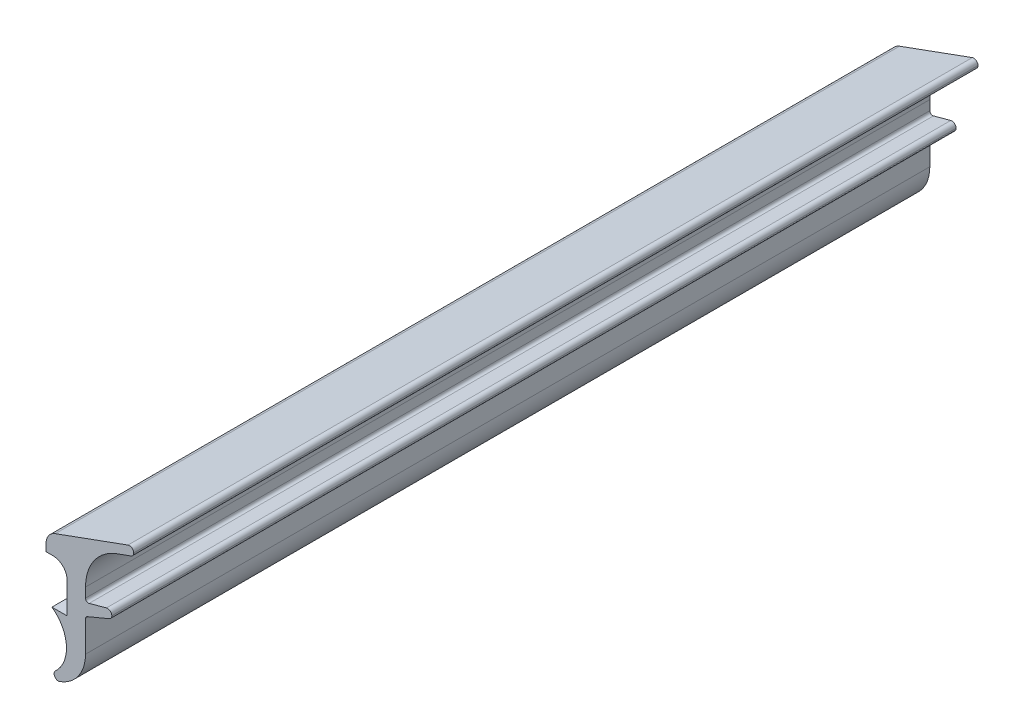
ISO-10303-21;
HEADER;
FILE_DESCRIPTION(('STEP AP214'),'2;1');
FILE_NAME('part.step','',(''),(''),'','','');
FILE_SCHEMA(('AUTOMOTIVE_DESIGN { 1 0 10303 214 1 1 1 1 }'));
ENDSEC;
DATA;
#1=APPLICATION_CONTEXT('core data for automotive mechanical design processes');
#2=APPLICATION_PROTOCOL_DEFINITION('international standard','automotive_design',2000,#1);
#3=PRODUCT_CONTEXT('',#1,'mechanical');
#4=PRODUCT('Part','Part','',(#3));
#5=PRODUCT_RELATED_PRODUCT_CATEGORY('part','',(#4));
#6=PRODUCT_DEFINITION_FORMATION('','',#4);
#7=PRODUCT_DEFINITION_CONTEXT('part definition',#1,'design');
#8=PRODUCT_DEFINITION('design','',#6,#7);
#9=PRODUCT_DEFINITION_SHAPE('','',#8);
#10=(LENGTH_UNIT() NAMED_UNIT(*) SI_UNIT(.MILLI.,.METRE.));
#11=(NAMED_UNIT(*) PLANE_ANGLE_UNIT() SI_UNIT($,.RADIAN.));
#12=(NAMED_UNIT(*) SI_UNIT($,.STERADIAN.) SOLID_ANGLE_UNIT());
#13=UNCERTAINTY_MEASURE_WITH_UNIT(LENGTH_MEASURE(1.E-05),#10,'distance_accuracy_value','');
#14=(GEOMETRIC_REPRESENTATION_CONTEXT(3) GLOBAL_UNCERTAINTY_ASSIGNED_CONTEXT((#13)) GLOBAL_UNIT_ASSIGNED_CONTEXT((#10,
#11,#12)) REPRESENTATION_CONTEXT('',''));
#15=CARTESIAN_POINT('',(0.,0.,0.));
#16=DIRECTION('',(0.,0.,1.));
#17=DIRECTION('',(1.,0.,0.));
#18=AXIS2_PLACEMENT_3D('',#15,#16,#17);
#19=CARTESIAN_POINT('',(1.26999999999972,0.635,0.));
#20=DIRECTION('',(0.,0.,1.));
#21=DIRECTION('',(1.,0.,0.));
#22=AXIS2_PLACEMENT_3D('',#19,#20,#21);
#23=PLANE('',#22);
#24=CARTESIAN_POINT('',(1.26999999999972,0.635,0.));
#25=DIRECTION('',(0.,0.,1.));
#26=DIRECTION('',(1.,0.,0.));
#27=AXIS2_PLACEMENT_3D('',#24,#25,#26);
#28=CIRCLE('',#27,1.26999999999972);
#29=CARTESIAN_POINT('',(0.835279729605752,1.82828047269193,0.));
#30=VERTEX_POINT('',#29);
#31=CARTESIAN_POINT('',(0.,0.635,0.));
#32=VERTEX_POINT('',#31);
#33=EDGE_CURVE('E417',#30,#32,#28,.T.);
#34=ORIENTED_EDGE('',*,*,#33,.T.);
#35=DIRECTION('',(0.,1.,0.));
#36=VECTOR('',#35,1.);
#37=CARTESIAN_POINT('',(0.,0.,0.));
#38=LINE('',#37,#36);
#39=CARTESIAN_POINT('',(0.,0.,0.));
#40=VERTEX_POINT('',#39);
#41=EDGE_CURVE('E18',#40,#32,#38,.T.);
#42=ORIENTED_EDGE('',*,*,#41,.F.);
#43=DIRECTION('',(-1.,0.,0.));
#44=VECTOR('',#43,1.);
#45=CARTESIAN_POINT('',(0.635,0.,0.));
#46=LINE('',#45,#44);
#47=CARTESIAN_POINT('',(0.635,0.,0.));
#48=VERTEX_POINT('',#47);
#49=EDGE_CURVE('E339',#48,#40,#46,.T.);
#50=ORIENTED_EDGE('',*,*,#49,.F.);
#51=CARTESIAN_POINT('',(0.635,-1.27,0.));
#52=DIRECTION('',(0.,0.,1.));
#53=DIRECTION('',(1.,0.,0.));
#54=AXIS2_PLACEMENT_3D('',#51,#52,#53);
#55=CIRCLE('',#54,1.27);
#56=CARTESIAN_POINT('',(1.905,-1.27,0.));
#57=VERTEX_POINT('',#56);
#58=EDGE_CURVE('E331',#57,#48,#55,.T.);
#59=ORIENTED_EDGE('',*,*,#58,.F.);
#60=DIRECTION('',(0.,1.,0.));
#61=VECTOR('',#60,1.);
#62=CARTESIAN_POINT('',(1.905,-4.064,0.));
#63=LINE('',#62,#61);
#64=CARTESIAN_POINT('',(1.905,-4.064,0.));
#65=VERTEX_POINT('',#64);
#66=EDGE_CURVE('E322',#65,#57,#63,.T.);
#67=ORIENTED_EDGE('',*,*,#66,.F.);
#68=DIRECTION('',(1.,0.,0.));
#69=VECTOR('',#68,1.);
#70=CARTESIAN_POINT('',(0.53339999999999,-4.064,0.));
#71=LINE('',#70,#69);
#72=CARTESIAN_POINT('',(0.533399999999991,-4.064,0.));
#73=VERTEX_POINT('',#72);
#74=EDGE_CURVE('E310',#73,#65,#71,.T.);
#75=ORIENTED_EDGE('',*,*,#74,.F.);
#76=CARTESIAN_POINT('',(-1.26875653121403,-6.60747603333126,0.));
#77=DIRECTION('',(0.,0.,1.));
#78=DIRECTION('',(1.,0.,0.));
#79=AXIS2_PLACEMENT_3D('',#76,#77,#78);
#80=CIRCLE('',#79,3.11721646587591);
#81=CARTESIAN_POINT('',(1.84845993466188,-6.60747603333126,0.));
#82=VERTEX_POINT('',#81);
#83=EDGE_CURVE('E366',#82,#73,#80,.T.);
#84=ORIENTED_EDGE('',*,*,#83,.F.);
#85=CARTESIAN_POINT('',(-1.26875653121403,-6.60747603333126,0.));
#86=DIRECTION('',(0.,0.,1.));
#87=DIRECTION('',(1.,0.,0.));
#88=AXIS2_PLACEMENT_3D('',#85,#86,#87);
#89=CIRCLE('',#88,3.11721646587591);
#90=CARTESIAN_POINT('',(0.85149478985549,-8.8925521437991,0.));
#91=VERTEX_POINT('',#90);
#92=EDGE_CURVE('E309',#91,#82,#89,.T.);
#93=ORIENTED_EDGE('',*,*,#92,.F.);
#94=CARTESIAN_POINT('',(1.11064129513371,-9.17184426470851,0.));
#95=DIRECTION('',(0.,0.,1.));
#96=DIRECTION('',(1.,0.,0.));
#97=AXIS2_PLACEMENT_3D('',#94,#95,#96);
#98=CIRCLE('',#97,0.380999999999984);
#99=CARTESIAN_POINT('',(1.23875695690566,-9.53065811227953,0.));
#100=VERTEX_POINT('',#99);
#101=EDGE_CURVE('E295',#91,#100,#98,.T.);
#102=ORIENTED_EDGE('',*,*,#101,.T.);
#103=CARTESIAN_POINT('',(0.0600928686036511,-6.22957071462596,0.));
#104=DIRECTION('',(0.,0.,1.));
#105=DIRECTION('',(1.,0.,0.));
#106=AXIS2_PLACEMENT_3D('',#103,#104,#105);
#107=CIRCLE('',#106,3.5052);
#108=CARTESIAN_POINT('',(3.56529286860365,-6.22957071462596,0.));
#109=VERTEX_POINT('',#108);
#110=EDGE_CURVE('E291',#100,#109,#107,.T.);
#111=ORIENTED_EDGE('',*,*,#110,.T.);
#112=DIRECTION('',(0.,-1.,0.));
#113=VECTOR('',#112,1.);
#114=CARTESIAN_POINT('',(3.56529286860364,-3.44813461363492,0.));
#115=LINE('',#114,#113);
#116=CARTESIAN_POINT('',(3.56529286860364,-3.44813461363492,0.));
#117=VERTEX_POINT('',#116);
#118=EDGE_CURVE('E279',#117,#109,#115,.T.);
#119=ORIENTED_EDGE('',*,*,#118,.F.);
#120=CARTESIAN_POINT('',(3.81929286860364,-3.44813461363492,0.));
#121=DIRECTION('',(0.,0.,1.));
#122=DIRECTION('',(1.,0.,0.));
#123=AXIS2_PLACEMENT_3D('',#120,#121,#122);
#124=CIRCLE('',#123,0.253999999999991);
#125=CARTESIAN_POINT('',(3.72120236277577,-3.2138393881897,0.));
#126=VERTEX_POINT('',#125);
#127=EDGE_CURVE('E266',#126,#117,#124,.T.);
#128=ORIENTED_EDGE('',*,*,#127,.F.);
#129=DIRECTION('',(-0.922422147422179,-0.386183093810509,0.));
#130=VECTOR('',#129,1.);
#131=CARTESIAN_POINT('',(5.7046557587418,-2.38344283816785,0.));
#132=LINE('',#131,#130);
#133=CARTESIAN_POINT('',(5.7046557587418,-2.38344283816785,0.));
#134=VERTEX_POINT('',#133);
#135=EDGE_CURVE('E228',#134,#126,#132,.T.);
#136=ORIENTED_EDGE('',*,*,#135,.F.);
#137=CARTESIAN_POINT('',(5.55752,-2.032,0.));
#138=DIRECTION('',(0.,0.,1.));
#139=DIRECTION('',(1.,0.,0.));
#140=AXIS2_PLACEMENT_3D('',#137,#138,#139);
#141=CIRCLE('',#140,0.381);
#142=CARTESIAN_POINT('',(5.93852,-2.032,0.));
#143=VERTEX_POINT('',#142);
#144=EDGE_CURVE('E223',#134,#143,#141,.T.);
#145=ORIENTED_EDGE('',*,*,#144,.T.);
#146=CARTESIAN_POINT('',(5.55752,-2.032,0.));
#147=DIRECTION('',(0.,0.,1.));
#148=DIRECTION('',(1.,0.,0.));
#149=AXIS2_PLACEMENT_3D('',#146,#147,#148);
#150=CIRCLE('',#149,0.381);
#151=CARTESIAN_POINT('',(5.45690876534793,-1.66452431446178,0.));
#152=VERTEX_POINT('',#151);
#153=EDGE_CURVE('E217',#143,#152,#150,.T.);
#154=ORIENTED_EDGE('',*,*,#153,.T.);
#155=DIRECTION('',(0.964503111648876,0.264071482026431,0.));
#156=VECTOR('',#155,1.);
#157=CARTESIAN_POINT('',(3.88636702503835,-2.09452322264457,0.));
#158=LINE('',#157,#156);
#159=CARTESIAN_POINT('',(3.88636702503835,-2.09452322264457,0.));
#160=VERTEX_POINT('',#159);
#161=EDGE_CURVE('E220',#160,#152,#158,.T.);
#162=ORIENTED_EDGE('',*,*,#161,.F.);
#163=CARTESIAN_POINT('',(3.81929286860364,-1.84953943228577,0.));
#164=DIRECTION('',(0.,0.,1.));
#165=DIRECTION('',(1.,0.,0.));
#166=AXIS2_PLACEMENT_3D('',#163,#164,#165);
#167=CIRCLE('',#166,0.25399999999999);
#168=CARTESIAN_POINT('',(3.56529286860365,-1.84953943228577,0.));
#169=VERTEX_POINT('',#168);
#170=EDGE_CURVE('E392',#169,#160,#167,.T.);
#171=ORIENTED_EDGE('',*,*,#170,.F.);
#172=DIRECTION('',(0.,-1.,0.));
#173=VECTOR('',#172,1.);
#174=CARTESIAN_POINT('',(3.56529286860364,-0.979547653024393,0.));
#175=LINE('',#174,#173);
#176=CARTESIAN_POINT('',(3.56529286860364,-0.979547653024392,0.));
#177=VERTEX_POINT('',#176);
#178=EDGE_CURVE('E488',#177,#169,#175,.T.);
#179=ORIENTED_EDGE('',*,*,#178,.F.);
#180=CARTESIAN_POINT('',(7.83249286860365,-0.979547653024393,0.));
#181=DIRECTION('',(0.,0.,1.));
#182=DIRECTION('',(1.,0.,0.));
#183=AXIS2_PLACEMENT_3D('',#180,#181,#182);
#184=CIRCLE('',#183,4.2672);
#185=CARTESIAN_POINT('',(6.37183276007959,3.02987473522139,0.));
#186=VERTEX_POINT('',#185);
#187=EDGE_CURVE('E476',#186,#177,#184,.T.);
#188=ORIENTED_EDGE('',*,*,#187,.F.);
#189=DIRECTION('',(-0.939590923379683,-0.342299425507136,0.));
#190=VECTOR('',#189,1.);
#191=CARTESIAN_POINT('',(7.66057567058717,3.49937262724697,0.));
#192=LINE('',#191,#190);
#193=CARTESIAN_POINT('',(7.66057567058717,3.49937262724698,0.));
#194=VERTEX_POINT('',#193);
#195=EDGE_CURVE('E464',#194,#186,#192,.T.);
#196=ORIENTED_EDGE('',*,*,#195,.F.);
#197=CARTESIAN_POINT('',(7.529449,3.85930729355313,0.));
#198=DIRECTION('',(0.,0.,1.));
#199=DIRECTION('',(1.,0.,0.));
#200=AXIS2_PLACEMENT_3D('',#197,#198,#199);
#201=CIRCLE('',#200,0.383075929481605);
#202=CARTESIAN_POINT('',(7.91252492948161,3.85930729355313,0.));
#203=VERTEX_POINT('',#202);
#204=EDGE_CURVE('E388',#194,#203,#201,.T.);
#205=ORIENTED_EDGE('',*,*,#204,.T.);
#206=CARTESIAN_POINT('',(7.529449,3.85930729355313,0.));
#207=DIRECTION('',(0.,0.,1.));
#208=DIRECTION('',(1.,0.,0.));
#209=AXIS2_PLACEMENT_3D('',#206,#207,#208);
#210=CIRCLE('',#209,0.383075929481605);
#211=CARTESIAN_POINT('',(7.39832232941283,4.21924195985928,0.));
#212=VERTEX_POINT('',#211);
#213=EDGE_CURVE('E459',#203,#212,#210,.T.);
#214=ORIENTED_EDGE('',*,*,#213,.T.);
#215=DIRECTION('',(0.939590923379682,0.342299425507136,0.));
#216=VECTOR('',#215,1.);
#217=CARTESIAN_POINT('',(0.835279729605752,1.82828047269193,0.));
#218=LINE('',#217,#216);
#219=EDGE_CURVE('E441',#30,#212,#218,.T.);
#220=ORIENTED_EDGE('',*,*,#219,.F.);
#221=EDGE_LOOP('',(#34,#42,#50,#59,#67,#75,#84,#93,#102,#111,#119,#128,#136,#145,#154,#162,#171,
#179,#188,#196,#205,#214,#220));
#222=FACE_BOUND('',#221,.T.);
#223=ADVANCED_FACE('F15',(#222),#23,.T.);
#224=CARTESIAN_POINT('',(1.26999999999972,0.635,-76.2));
#225=DIRECTION('',(0.,0.,1.));
#226=DIRECTION('',(1.,0.,0.));
#227=AXIS2_PLACEMENT_3D('',#224,#225,#226);
#228=PLANE('',#227);
#229=CARTESIAN_POINT('',(1.26999999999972,0.635,-76.2));
#230=DIRECTION('',(0.,0.,1.));
#231=DIRECTION('',(1.,0.,0.));
#232=AXIS2_PLACEMENT_3D('',#229,#230,#231);
#233=CIRCLE('',#232,1.26999999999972);
#234=CARTESIAN_POINT('',(0.835279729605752,1.82828047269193,-76.2));
#235=VERTEX_POINT('',#234);
#236=CARTESIAN_POINT('',(0.,0.635,-76.2));
#237=VERTEX_POINT('',#236);
#238=EDGE_CURVE('E416',#235,#237,#233,.T.);
#239=ORIENTED_EDGE('',*,*,#238,.F.);
#240=DIRECTION('',(0.939590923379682,0.342299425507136,0.));
#241=VECTOR('',#240,1.);
#242=CARTESIAN_POINT('',(0.835279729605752,1.82828047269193,-76.2));
#243=LINE('',#242,#241);
#244=CARTESIAN_POINT('',(7.39832232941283,4.21924195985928,-76.2));
#245=VERTEX_POINT('',#244);
#246=EDGE_CURVE('E452',#235,#245,#243,.T.);
#247=ORIENTED_EDGE('',*,*,#246,.T.);
#248=CARTESIAN_POINT('',(7.529449,3.85930729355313,-76.2));
#249=DIRECTION('',(0.,0.,1.));
#250=DIRECTION('',(1.,0.,0.));
#251=AXIS2_PLACEMENT_3D('',#248,#249,#250);
#252=CIRCLE('',#251,0.383075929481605);
#253=CARTESIAN_POINT('',(7.91252492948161,3.85930729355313,-76.2));
#254=VERTEX_POINT('',#253);
#255=EDGE_CURVE('E456',#254,#245,#252,.T.);
#256=ORIENTED_EDGE('',*,*,#255,.F.);
#257=CARTESIAN_POINT('',(7.529449,3.85930729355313,-76.2));
#258=DIRECTION('',(0.,0.,1.));
#259=DIRECTION('',(1.,0.,0.));
#260=AXIS2_PLACEMENT_3D('',#257,#258,#259);
#261=CIRCLE('',#260,0.383075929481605);
#262=CARTESIAN_POINT('',(7.66057567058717,3.49937262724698,-76.2));
#263=VERTEX_POINT('',#262);
#264=EDGE_CURVE('E389',#263,#254,#261,.T.);
#265=ORIENTED_EDGE('',*,*,#264,.F.);
#266=DIRECTION('',(-0.939590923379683,-0.342299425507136,0.));
#267=VECTOR('',#266,1.);
#268=CARTESIAN_POINT('',(7.66057567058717,3.49937262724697,-76.2));
#269=LINE('',#268,#267);
#270=CARTESIAN_POINT('',(6.37183276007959,3.02987473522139,-76.2));
#271=VERTEX_POINT('',#270);
#272=EDGE_CURVE('E472',#263,#271,#269,.T.);
#273=ORIENTED_EDGE('',*,*,#272,.T.);
#274=CARTESIAN_POINT('',(7.83249286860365,-0.979547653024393,-76.2));
#275=DIRECTION('',(0.,0.,1.));
#276=DIRECTION('',(1.,0.,0.));
#277=AXIS2_PLACEMENT_3D('',#274,#275,#276);
#278=CIRCLE('',#277,4.2672);
#279=CARTESIAN_POINT('',(3.56529286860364,-0.979547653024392,-76.2));
#280=VERTEX_POINT('',#279);
#281=EDGE_CURVE('E484',#271,#280,#278,.T.);
#282=ORIENTED_EDGE('',*,*,#281,.T.);
#283=DIRECTION('',(0.,-1.,0.));
#284=VECTOR('',#283,1.);
#285=CARTESIAN_POINT('',(3.56529286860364,-0.979547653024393,-76.2));
#286=LINE('',#285,#284);
#287=CARTESIAN_POINT('',(3.56529286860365,-1.84953943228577,-76.2));
#288=VERTEX_POINT('',#287);
#289=EDGE_CURVE('E394',#280,#288,#286,.T.);
#290=ORIENTED_EDGE('',*,*,#289,.T.);
#291=CARTESIAN_POINT('',(3.81929286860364,-1.84953943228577,-76.2));
#292=DIRECTION('',(0.,0.,1.));
#293=DIRECTION('',(1.,0.,0.));
#294=AXIS2_PLACEMENT_3D('',#291,#292,#293);
#295=CIRCLE('',#294,0.25399999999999);
#296=CARTESIAN_POINT('',(3.88636702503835,-2.09452322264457,-76.2));
#297=VERTEX_POINT('',#296);
#298=EDGE_CURVE('E244',#288,#297,#295,.T.);
#299=ORIENTED_EDGE('',*,*,#298,.T.);
#300=DIRECTION('',(0.964503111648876,0.264071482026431,0.));
#301=VECTOR('',#300,1.);
#302=CARTESIAN_POINT('',(3.88636702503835,-2.09452322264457,-76.2));
#303=LINE('',#302,#301);
#304=CARTESIAN_POINT('',(5.45690876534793,-1.66452431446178,-76.2));
#305=VERTEX_POINT('',#304);
#306=EDGE_CURVE('E237',#297,#305,#303,.T.);
#307=ORIENTED_EDGE('',*,*,#306,.T.);
#308=CARTESIAN_POINT('',(5.55752,-2.032,-76.2));
#309=DIRECTION('',(0.,0.,1.));
#310=DIRECTION('',(1.,0.,0.));
#311=AXIS2_PLACEMENT_3D('',#308,#309,#310);
#312=CIRCLE('',#311,0.381);
#313=CARTESIAN_POINT('',(5.93852,-2.032,-76.2));
#314=VERTEX_POINT('',#313);
#315=EDGE_CURVE('E229',#314,#305,#312,.T.);
#316=ORIENTED_EDGE('',*,*,#315,.F.);
#317=CARTESIAN_POINT('',(5.55752,-2.032,-76.2));
#318=DIRECTION('',(0.,0.,1.));
#319=DIRECTION('',(1.,0.,0.));
#320=AXIS2_PLACEMENT_3D('',#317,#318,#319);
#321=CIRCLE('',#320,0.381);
#322=CARTESIAN_POINT('',(5.7046557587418,-2.38344283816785,-76.2));
#323=VERTEX_POINT('',#322);
#324=EDGE_CURVE('E402',#323,#314,#321,.T.);
#325=ORIENTED_EDGE('',*,*,#324,.F.);
#326=DIRECTION('',(-0.922422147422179,-0.386183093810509,0.));
#327=VECTOR('',#326,1.);
#328=CARTESIAN_POINT('',(5.7046557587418,-2.38344283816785,-76.2));
#329=LINE('',#328,#327);
#330=CARTESIAN_POINT('',(3.72120236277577,-3.2138393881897,-76.2));
#331=VERTEX_POINT('',#330);
#332=EDGE_CURVE('E271',#323,#331,#329,.T.);
#333=ORIENTED_EDGE('',*,*,#332,.T.);
#334=CARTESIAN_POINT('',(3.81929286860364,-3.44813461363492,-76.2));
#335=DIRECTION('',(0.,0.,1.));
#336=DIRECTION('',(1.,0.,0.));
#337=AXIS2_PLACEMENT_3D('',#334,#335,#336);
#338=CIRCLE('',#337,0.253999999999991);
#339=CARTESIAN_POINT('',(3.56529286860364,-3.44813461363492,-76.2));
#340=VERTEX_POINT('',#339);
#341=EDGE_CURVE('E275',#331,#340,#338,.T.);
#342=ORIENTED_EDGE('',*,*,#341,.T.);
#343=DIRECTION('',(0.,-1.,0.));
#344=VECTOR('',#343,1.);
#345=CARTESIAN_POINT('',(3.56529286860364,-3.44813461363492,-76.2));
#346=LINE('',#345,#344);
#347=CARTESIAN_POINT('',(3.56529286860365,-6.22957071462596,-76.2));
#348=VERTEX_POINT('',#347);
#349=EDGE_CURVE('E287',#340,#348,#346,.T.);
#350=ORIENTED_EDGE('',*,*,#349,.T.);
#351=CARTESIAN_POINT('',(0.0600928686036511,-6.22957071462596,-76.2));
#352=DIRECTION('',(0.,0.,1.));
#353=DIRECTION('',(1.,0.,0.));
#354=AXIS2_PLACEMENT_3D('',#351,#352,#353);
#355=CIRCLE('',#354,3.5052);
#356=CARTESIAN_POINT('',(1.23875695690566,-9.53065811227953,-76.2));
#357=VERTEX_POINT('',#356);
#358=EDGE_CURVE('E292',#357,#348,#355,.T.);
#359=ORIENTED_EDGE('',*,*,#358,.F.);
#360=CARTESIAN_POINT('',(1.11064129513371,-9.17184426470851,-76.2));
#361=DIRECTION('',(0.,0.,1.));
#362=DIRECTION('',(1.,0.,0.));
#363=AXIS2_PLACEMENT_3D('',#360,#361,#362);
#364=CIRCLE('',#363,0.380999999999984);
#365=CARTESIAN_POINT('',(0.85149478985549,-8.8925521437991,-76.2));
#366=VERTEX_POINT('',#365);
#367=EDGE_CURVE('E303',#366,#357,#364,.T.);
#368=ORIENTED_EDGE('',*,*,#367,.F.);
#369=CARTESIAN_POINT('',(-1.26875653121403,-6.60747603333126,-76.2));
#370=DIRECTION('',(0.,0.,1.));
#371=DIRECTION('',(1.,0.,0.));
#372=AXIS2_PLACEMENT_3D('',#369,#370,#371);
#373=CIRCLE('',#372,3.11721646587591);
#374=CARTESIAN_POINT('',(1.84845993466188,-6.60747603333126,-76.2));
#375=VERTEX_POINT('',#374);
#376=EDGE_CURVE('E306',#366,#375,#373,.T.);
#377=ORIENTED_EDGE('',*,*,#376,.T.);
#378=CARTESIAN_POINT('',(-1.26875653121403,-6.60747603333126,-76.2));
#379=DIRECTION('',(0.,0.,1.));
#380=DIRECTION('',(1.,0.,0.));
#381=AXIS2_PLACEMENT_3D('',#378,#379,#380);
#382=CIRCLE('',#381,3.11721646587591);
#383=CARTESIAN_POINT('',(0.533399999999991,-4.064,-76.2));
#384=VERTEX_POINT('',#383);
#385=EDGE_CURVE('E376',#375,#384,#382,.T.);
#386=ORIENTED_EDGE('',*,*,#385,.T.);
#387=DIRECTION('',(1.,0.,0.));
#388=VECTOR('',#387,1.);
#389=CARTESIAN_POINT('',(0.53339999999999,-4.064,-76.2));
#390=LINE('',#389,#388);
#391=CARTESIAN_POINT('',(1.905,-4.064,-76.2));
#392=VERTEX_POINT('',#391);
#393=EDGE_CURVE('E318',#384,#392,#390,.T.);
#394=ORIENTED_EDGE('',*,*,#393,.T.);
#395=DIRECTION('',(0.,1.,0.));
#396=VECTOR('',#395,1.);
#397=CARTESIAN_POINT('',(1.905,-4.064,-76.2));
#398=LINE('',#397,#396);
#399=CARTESIAN_POINT('',(1.905,-1.27,-76.2));
#400=VERTEX_POINT('',#399);
#401=EDGE_CURVE('E330',#392,#400,#398,.T.);
#402=ORIENTED_EDGE('',*,*,#401,.T.);
#403=CARTESIAN_POINT('',(0.635,-1.27,-76.2));
#404=DIRECTION('',(0.,0.,1.));
#405=DIRECTION('',(1.,0.,0.));
#406=AXIS2_PLACEMENT_3D('',#403,#404,#405);
#407=CIRCLE('',#406,1.27);
#408=CARTESIAN_POINT('',(0.635,0.,-76.2));
#409=VERTEX_POINT('',#408);
#410=EDGE_CURVE('E252',#400,#409,#407,.T.);
#411=ORIENTED_EDGE('',*,*,#410,.T.);
#412=DIRECTION('',(-1.,0.,0.));
#413=VECTOR('',#412,1.);
#414=CARTESIAN_POINT('',(0.635,0.,-76.2));
#415=LINE('',#414,#413);
#416=CARTESIAN_POINT('',(0.,0.,-76.2));
#417=VERTEX_POINT('',#416);
#418=EDGE_CURVE('E256',#409,#417,#415,.T.);
#419=ORIENTED_EDGE('',*,*,#418,.T.);
#420=DIRECTION('',(0.,1.,0.));
#421=VECTOR('',#420,1.);
#422=CARTESIAN_POINT('',(0.,0.,-76.2));
#423=LINE('',#422,#421);
#424=EDGE_CURVE('E9',#417,#237,#423,.T.);
#425=ORIENTED_EDGE('',*,*,#424,.T.);
#426=EDGE_LOOP('',(#239,#247,#256,#265,#273,#282,#290,#299,#307,#316,#325,#333,#342,#350,#359,
#368,#377,#386,#394,#402,#411,#419,#425));
#427=FACE_BOUND('',#426,.T.);
#428=ADVANCED_FACE('F510',(#427),#228,.F.);
#429=CARTESIAN_POINT('',(0.,0.,-76.2));
#430=DIRECTION('',(1.,0.,0.));
#431=DIRECTION('',(0.,1.,0.));
#432=AXIS2_PLACEMENT_3D('',#429,#430,#431);
#433=PLANE('',#432);
#434=ORIENTED_EDGE('',*,*,#41,.T.);
#435=DIRECTION('',(0.,0.,1.));
#436=VECTOR('',#435,1.);
#437=CARTESIAN_POINT('',(0.,0.635,-76.2));
#438=LINE('',#437,#436);
#439=EDGE_CURVE('E427',#237,#32,#438,.T.);
#440=ORIENTED_EDGE('',*,*,#439,.F.);
#441=ORIENTED_EDGE('',*,*,#424,.F.);
#442=DIRECTION('',(0.,0.,1.));
#443=VECTOR('',#442,1.);
#444=CARTESIAN_POINT('',(0.,0.,-76.2));
#445=LINE('',#444,#443);
#446=EDGE_CURVE('E259',#417,#40,#445,.T.);
#447=ORIENTED_EDGE('',*,*,#446,.T.);
#448=EDGE_LOOP('',(#434,#440,#441,#447));
#449=FACE_BOUND('',#448,.T.);
#450=ADVANCED_FACE('F346',(#449),#433,.F.);
#451=CARTESIAN_POINT('',(0.635,0.,-76.2));
#452=DIRECTION('',(0.,1.,0.));
#453=DIRECTION('',(1.,0.,0.));
#454=AXIS2_PLACEMENT_3D('',#451,#452,#453);
#455=PLANE('',#454);
#456=ORIENTED_EDGE('',*,*,#49,.T.);
#457=ORIENTED_EDGE('',*,*,#446,.F.);
#458=ORIENTED_EDGE('',*,*,#418,.F.);
#459=DIRECTION('',(0.,0.,1.));
#460=VECTOR('',#459,1.);
#461=CARTESIAN_POINT('',(0.635,0.,-76.2));
#462=LINE('',#461,#460);
#463=EDGE_CURVE('E335',#409,#48,#462,.T.);
#464=ORIENTED_EDGE('',*,*,#463,.T.);
#465=EDGE_LOOP('',(#456,#457,#458,#464));
#466=FACE_BOUND('',#465,.T.);
#467=ADVANCED_FACE('F349',(#466),#455,.F.);
#468=CARTESIAN_POINT('',(0.635,-1.27,-76.2));
#469=DIRECTION('',(0.,0.,1.));
#470=DIRECTION('',(1.,0.,0.));
#471=AXIS2_PLACEMENT_3D('',#468,#469,#470);
#472=CYLINDRICAL_SURFACE('',#471,1.27);
#473=ORIENTED_EDGE('',*,*,#58,.T.);
#474=ORIENTED_EDGE('',*,*,#463,.F.);
#475=ORIENTED_EDGE('',*,*,#410,.F.);
#476=DIRECTION('',(0.,0.,1.));
#477=VECTOR('',#476,1.);
#478=CARTESIAN_POINT('',(1.905,-1.27,-76.2));
#479=LINE('',#478,#477);
#480=EDGE_CURVE('E326',#400,#57,#479,.T.);
#481=ORIENTED_EDGE('',*,*,#480,.T.);
#482=EDGE_LOOP('',(#473,#474,#475,#481));
#483=FACE_BOUND('',#482,.T.);
#484=ADVANCED_FACE('F353',(#483),#472,.F.);
#485=CARTESIAN_POINT('',(1.905,-4.064,-76.2));
#486=DIRECTION('',(1.,0.,0.));
#487=DIRECTION('',(0.,-1.,0.));
#488=AXIS2_PLACEMENT_3D('',#485,#486,#487);
#489=PLANE('',#488);
#490=ORIENTED_EDGE('',*,*,#66,.T.);
#491=ORIENTED_EDGE('',*,*,#480,.F.);
#492=ORIENTED_EDGE('',*,*,#401,.F.);
#493=DIRECTION('',(0.,0.,1.));
#494=VECTOR('',#493,1.);
#495=CARTESIAN_POINT('',(1.905,-4.064,-76.2));
#496=LINE('',#495,#494);
#497=EDGE_CURVE('E314',#392,#65,#496,.T.);
#498=ORIENTED_EDGE('',*,*,#497,.T.);
#499=EDGE_LOOP('',(#490,#491,#492,#498));
#500=FACE_BOUND('',#499,.T.);
#501=ADVANCED_FACE('F357',(#500),#489,.F.);
#502=CARTESIAN_POINT('',(0.53339999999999,-4.064,-76.2));
#503=DIRECTION('',(0.,-1.,0.));
#504=DIRECTION('',(0.,0.,-1.));
#505=AXIS2_PLACEMENT_3D('',#502,#503,#504);
#506=PLANE('',#505);
#507=ORIENTED_EDGE('',*,*,#74,.T.);
#508=ORIENTED_EDGE('',*,*,#497,.F.);
#509=ORIENTED_EDGE('',*,*,#393,.F.);
#510=DIRECTION('',(0.,0.,1.));
#511=VECTOR('',#510,1.);
#512=CARTESIAN_POINT('',(0.533399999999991,-4.064,-76.2));
#513=LINE('',#512,#511);
#514=EDGE_CURVE('E363',#384,#73,#513,.T.);
#515=ORIENTED_EDGE('',*,*,#514,.T.);
#516=EDGE_LOOP('',(#507,#508,#509,#515));
#517=FACE_BOUND('',#516,.T.);
#518=ADVANCED_FACE('F361',(#517),#506,.F.);
#519=CARTESIAN_POINT('',(-1.26875653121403,-6.60747603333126,-76.2));
#520=DIRECTION('',(0.,0.,1.));
#521=DIRECTION('',(1.,0.,0.));
#522=AXIS2_PLACEMENT_3D('',#519,#520,#521);
#523=CYLINDRICAL_SURFACE('',#522,3.11721646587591);
#524=DIRECTION('',(0.,0.,1.));
#525=VECTOR('',#524,1.);
#526=CARTESIAN_POINT('',(1.84845993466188,-6.60747603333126,-76.2));
#527=LINE('',#526,#525);
#528=EDGE_CURVE('E370',#375,#82,#527,.T.);
#529=ORIENTED_EDGE('',*,*,#528,.F.);
#530=ORIENTED_EDGE('',*,*,#376,.F.);
#531=DIRECTION('',(0.,0.,1.));
#532=VECTOR('',#531,1.);
#533=CARTESIAN_POINT('',(0.85149478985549,-8.8925521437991,-76.2));
#534=LINE('',#533,#532);
#535=EDGE_CURVE('E299',#366,#91,#534,.T.);
#536=ORIENTED_EDGE('',*,*,#535,.T.);
#537=ORIENTED_EDGE('',*,*,#92,.T.);
#538=EDGE_LOOP('',(#529,#530,#536,#537));
#539=FACE_BOUND('',#538,.T.);
#540=ADVANCED_FACE('F514',(#539),#523,.F.);
#541=CARTESIAN_POINT('',(1.11064129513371,-9.17184426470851,-76.2));
#542=DIRECTION('',(0.,0.,1.));
#543=DIRECTION('',(1.,0.,0.));
#544=AXIS2_PLACEMENT_3D('',#541,#542,#543);
#545=CYLINDRICAL_SURFACE('',#544,0.380999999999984);
#546=ORIENTED_EDGE('',*,*,#101,.F.);
#547=ORIENTED_EDGE('',*,*,#535,.F.);
#548=ORIENTED_EDGE('',*,*,#367,.T.);
#549=DIRECTION('',(0.,0.,1.));
#550=VECTOR('',#549,1.);
#551=CARTESIAN_POINT('',(1.23875695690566,-9.53065811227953,-76.2));
#552=LINE('',#551,#550);
#553=EDGE_CURVE('E296',#357,#100,#552,.T.);
#554=ORIENTED_EDGE('',*,*,#553,.T.);
#555=EDGE_LOOP('',(#546,#547,#548,#554));
#556=FACE_BOUND('',#555,.T.);
#557=ADVANCED_FACE('F517',(#556),#545,.T.);
#558=CARTESIAN_POINT('',(0.0600928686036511,-6.22957071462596,-76.2));
#559=DIRECTION('',(0.,0.,1.));
#560=DIRECTION('',(1.,0.,0.));
#561=AXIS2_PLACEMENT_3D('',#558,#559,#560);
#562=CYLINDRICAL_SURFACE('',#561,3.5052);
#563=ORIENTED_EDGE('',*,*,#110,.F.);
#564=ORIENTED_EDGE('',*,*,#553,.F.);
#565=ORIENTED_EDGE('',*,*,#358,.T.);
#566=DIRECTION('',(0.,0.,1.));
#567=VECTOR('',#566,1.);
#568=CARTESIAN_POINT('',(3.56529286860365,-6.22957071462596,-76.2));
#569=LINE('',#568,#567);
#570=EDGE_CURVE('E283',#348,#109,#569,.T.);
#571=ORIENTED_EDGE('',*,*,#570,.T.);
#572=EDGE_LOOP('',(#563,#564,#565,#571));
#573=FACE_BOUND('',#572,.T.);
#574=ADVANCED_FACE('F522',(#573),#562,.T.);
#575=CARTESIAN_POINT('',(3.56529286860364,-3.44813461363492,-76.2));
#576=DIRECTION('',(-1.,0.,0.));
#577=DIRECTION('',(0.,1.,0.));
#578=AXIS2_PLACEMENT_3D('',#575,#576,#577);
#579=PLANE('',#578);
#580=ORIENTED_EDGE('',*,*,#118,.T.);
#581=ORIENTED_EDGE('',*,*,#570,.F.);
#582=ORIENTED_EDGE('',*,*,#349,.F.);
#583=DIRECTION('',(0.,0.,1.));
#584=VECTOR('',#583,1.);
#585=CARTESIAN_POINT('',(3.56529286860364,-3.44813461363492,-76.2));
#586=LINE('',#585,#584);
#587=EDGE_CURVE('E270',#340,#117,#586,.T.);
#588=ORIENTED_EDGE('',*,*,#587,.T.);
#589=EDGE_LOOP('',(#580,#581,#582,#588));
#590=FACE_BOUND('',#589,.T.);
#591=ADVANCED_FACE('F524',(#590),#579,.F.);
#592=CARTESIAN_POINT('',(3.81929286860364,-3.44813461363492,-76.2));
#593=DIRECTION('',(0.,0.,1.));
#594=DIRECTION('',(1.,0.,0.));
#595=AXIS2_PLACEMENT_3D('',#592,#593,#594);
#596=CYLINDRICAL_SURFACE('',#595,0.253999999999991);
#597=ORIENTED_EDGE('',*,*,#127,.T.);
#598=ORIENTED_EDGE('',*,*,#587,.F.);
#599=ORIENTED_EDGE('',*,*,#341,.F.);
#600=DIRECTION('',(0.,0.,1.));
#601=VECTOR('',#600,1.);
#602=CARTESIAN_POINT('',(3.72120236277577,-3.2138393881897,-76.2));
#603=LINE('',#602,#601);
#604=EDGE_CURVE('E265',#331,#126,#603,.T.);
#605=ORIENTED_EDGE('',*,*,#604,.T.);
#606=EDGE_LOOP('',(#597,#598,#599,#605));
#607=FACE_BOUND('',#606,.T.);
#608=ADVANCED_FACE('F527',(#607),#596,.F.);
#609=CARTESIAN_POINT('',(5.7046557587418,-2.38344283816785,-76.2));
#610=DIRECTION('',(-0.386183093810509,0.922422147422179,0.));
#611=DIRECTION('',(0.,0.,1.));
#612=AXIS2_PLACEMENT_3D('',#609,#610,#611);
#613=PLANE('',#612);
#614=ORIENTED_EDGE('',*,*,#135,.T.);
#615=ORIENTED_EDGE('',*,*,#604,.F.);
#616=ORIENTED_EDGE('',*,*,#332,.F.);
#617=DIRECTION('',(0.,0.,1.));
#618=VECTOR('',#617,1.);
#619=CARTESIAN_POINT('',(5.7046557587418,-2.38344283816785,-76.2));
#620=LINE('',#619,#618);
#621=EDGE_CURVE('E420',#323,#134,#620,.T.);
#622=ORIENTED_EDGE('',*,*,#621,.T.);
#623=EDGE_LOOP('',(#614,#615,#616,#622));
#624=FACE_BOUND('',#623,.T.);
#625=ADVANCED_FACE('F531',(#624),#613,.F.);
#626=CARTESIAN_POINT('',(5.55752,-2.032,-76.2));
#627=DIRECTION('',(0.,0.,1.));
#628=DIRECTION('',(1.,0.,0.));
#629=AXIS2_PLACEMENT_3D('',#626,#627,#628);
#630=CYLINDRICAL_SURFACE('',#629,0.381);
#631=DIRECTION('',(0.,0.,1.));
#632=VECTOR('',#631,1.);
#633=CARTESIAN_POINT('',(5.93852,-2.032,-76.2));
#634=LINE('',#633,#632);
#635=EDGE_CURVE('E406',#314,#143,#634,.T.);
#636=ORIENTED_EDGE('',*,*,#635,.F.);
#637=ORIENTED_EDGE('',*,*,#315,.T.);
#638=DIRECTION('',(0.,0.,1.));
#639=VECTOR('',#638,1.);
#640=CARTESIAN_POINT('',(5.45690876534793,-1.66452431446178,-76.2));
#641=LINE('',#640,#639);
#642=EDGE_CURVE('E232',#305,#152,#641,.T.);
#643=ORIENTED_EDGE('',*,*,#642,.T.);
#644=ORIENTED_EDGE('',*,*,#153,.F.);
#645=EDGE_LOOP('',(#636,#637,#643,#644));
#646=FACE_BOUND('',#645,.T.);
#647=ADVANCED_FACE('F233',(#646),#630,.T.);
#648=CARTESIAN_POINT('',(3.88636702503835,-2.09452322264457,-76.2));
#649=DIRECTION('',(0.264071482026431,-0.964503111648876,0.));
#650=DIRECTION('',(0.,0.,-1.));
#651=AXIS2_PLACEMENT_3D('',#648,#649,#650);
#652=PLANE('',#651);
#653=ORIENTED_EDGE('',*,*,#161,.T.);
#654=ORIENTED_EDGE('',*,*,#642,.F.);
#655=ORIENTED_EDGE('',*,*,#306,.F.);
#656=DIRECTION('',(0.,0.,1.));
#657=VECTOR('',#656,1.);
#658=CARTESIAN_POINT('',(3.88636702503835,-2.09452322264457,-76.2));
#659=LINE('',#658,#657);
#660=EDGE_CURVE('E241',#297,#160,#659,.T.);
#661=ORIENTED_EDGE('',*,*,#660,.T.);
#662=EDGE_LOOP('',(#653,#654,#655,#661));
#663=FACE_BOUND('',#662,.T.);
#664=ADVANCED_FACE('F239',(#663),#652,.F.);
#665=CARTESIAN_POINT('',(3.81929286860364,-1.84953943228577,-76.2));
#666=DIRECTION('',(0.,0.,1.));
#667=DIRECTION('',(1.,0.,0.));
#668=AXIS2_PLACEMENT_3D('',#665,#666,#667);
#669=CYLINDRICAL_SURFACE('',#668,0.25399999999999);
#670=ORIENTED_EDGE('',*,*,#170,.T.);
#671=ORIENTED_EDGE('',*,*,#660,.F.);
#672=ORIENTED_EDGE('',*,*,#298,.F.);
#673=DIRECTION('',(0.,0.,1.));
#674=VECTOR('',#673,1.);
#675=CARTESIAN_POINT('',(3.56529286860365,-1.84953943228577,-76.2));
#676=LINE('',#675,#674);
#677=EDGE_CURVE('E492',#288,#169,#676,.T.);
#678=ORIENTED_EDGE('',*,*,#677,.T.);
#679=EDGE_LOOP('',(#670,#671,#672,#678));
#680=FACE_BOUND('',#679,.T.);
#681=ADVANCED_FACE('F537',(#680),#669,.F.);
#682=CARTESIAN_POINT('',(3.56529286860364,-0.979547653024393,-76.2));
#683=DIRECTION('',(-1.,0.,0.));
#684=DIRECTION('',(0.,1.,0.));
#685=AXIS2_PLACEMENT_3D('',#682,#683,#684);
#686=PLANE('',#685);
#687=ORIENTED_EDGE('',*,*,#178,.T.);
#688=ORIENTED_EDGE('',*,*,#677,.F.);
#689=ORIENTED_EDGE('',*,*,#289,.F.);
#690=DIRECTION('',(0.,0.,1.));
#691=VECTOR('',#690,1.);
#692=CARTESIAN_POINT('',(3.56529286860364,-0.979547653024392,-76.2));
#693=LINE('',#692,#691);
#694=EDGE_CURVE('E480',#280,#177,#693,.T.);
#695=ORIENTED_EDGE('',*,*,#694,.T.);
#696=EDGE_LOOP('',(#687,#688,#689,#695));
#697=FACE_BOUND('',#696,.T.);
#698=ADVANCED_FACE('F540',(#697),#686,.F.);
#699=CARTESIAN_POINT('',(7.83249286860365,-0.979547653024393,-76.2));
#700=DIRECTION('',(0.,0.,1.));
#701=DIRECTION('',(1.,0.,0.));
#702=AXIS2_PLACEMENT_3D('',#699,#700,#701);
#703=CYLINDRICAL_SURFACE('',#702,4.2672);
#704=ORIENTED_EDGE('',*,*,#187,.T.);
#705=ORIENTED_EDGE('',*,*,#694,.F.);
#706=ORIENTED_EDGE('',*,*,#281,.F.);
#707=DIRECTION('',(0.,0.,1.));
#708=VECTOR('',#707,1.);
#709=CARTESIAN_POINT('',(6.37183276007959,3.02987473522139,-76.2));
#710=LINE('',#709,#708);
#711=EDGE_CURVE('E468',#271,#186,#710,.T.);
#712=ORIENTED_EDGE('',*,*,#711,.T.);
#713=EDGE_LOOP('',(#704,#705,#706,#712));
#714=FACE_BOUND('',#713,.T.);
#715=ADVANCED_FACE('F542',(#714),#703,.F.);
#716=CARTESIAN_POINT('',(7.66057567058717,3.49937262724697,-76.2));
#717=DIRECTION('',(-0.342299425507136,0.939590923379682,0.));
#718=DIRECTION('',(0.,0.,1.));
#719=AXIS2_PLACEMENT_3D('',#716,#717,#718);
#720=PLANE('',#719);
#721=ORIENTED_EDGE('',*,*,#195,.T.);
#722=ORIENTED_EDGE('',*,*,#711,.F.);
#723=ORIENTED_EDGE('',*,*,#272,.F.);
#724=DIRECTION('',(0.,0.,1.));
#725=VECTOR('',#724,1.);
#726=CARTESIAN_POINT('',(7.66057567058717,3.49937262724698,-76.2));
#727=LINE('',#726,#725);
#728=EDGE_CURVE('E399',#263,#194,#727,.T.);
#729=ORIENTED_EDGE('',*,*,#728,.T.);
#730=EDGE_LOOP('',(#721,#722,#723,#729));
#731=FACE_BOUND('',#730,.T.);
#732=ADVANCED_FACE('F545',(#731),#720,.F.);
#733=CARTESIAN_POINT('',(7.529449,3.85930729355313,-76.2));
#734=DIRECTION('',(0.,0.,1.));
#735=DIRECTION('',(1.,0.,0.));
#736=AXIS2_PLACEMENT_3D('',#733,#734,#735);
#737=CYLINDRICAL_SURFACE('',#736,0.383075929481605);
#738=DIRECTION('',(0.,0.,1.));
#739=VECTOR('',#738,1.);
#740=CARTESIAN_POINT('',(7.91252492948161,3.85930729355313,-76.2));
#741=LINE('',#740,#739);
#742=EDGE_CURVE('E385',#254,#203,#741,.T.);
#743=ORIENTED_EDGE('',*,*,#742,.F.);
#744=ORIENTED_EDGE('',*,*,#255,.T.);
#745=DIRECTION('',(0.,0.,1.));
#746=VECTOR('',#745,1.);
#747=CARTESIAN_POINT('',(7.39832232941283,4.21924195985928,-76.2));
#748=LINE('',#747,#746);
#749=EDGE_CURVE('E445',#245,#212,#748,.T.);
#750=ORIENTED_EDGE('',*,*,#749,.T.);
#751=ORIENTED_EDGE('',*,*,#213,.F.);
#752=EDGE_LOOP('',(#743,#744,#750,#751));
#753=FACE_BOUND('',#752,.T.);
#754=ADVANCED_FACE('F553',(#753),#737,.T.);
#755=CARTESIAN_POINT('',(0.835279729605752,1.82828047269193,-76.2));
#756=DIRECTION('',(0.342299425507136,-0.939590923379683,0.));
#757=DIRECTION('',(0.,0.,-1.));
#758=AXIS2_PLACEMENT_3D('',#755,#756,#757);
#759=PLANE('',#758);
#760=ORIENTED_EDGE('',*,*,#219,.T.);
#761=ORIENTED_EDGE('',*,*,#749,.F.);
#762=ORIENTED_EDGE('',*,*,#246,.F.);
#763=DIRECTION('',(0.,0.,1.));
#764=VECTOR('',#763,1.);
#765=CARTESIAN_POINT('',(0.835279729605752,1.82828047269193,-76.2));
#766=LINE('',#765,#764);
#767=EDGE_CURVE('E412',#235,#30,#766,.T.);
#768=ORIENTED_EDGE('',*,*,#767,.T.);
#769=EDGE_LOOP('',(#760,#761,#762,#768));
#770=FACE_BOUND('',#769,.T.);
#771=ADVANCED_FACE('F556',(#770),#759,.F.);
#772=CARTESIAN_POINT('',(1.26999999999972,0.635,-76.2));
#773=DIRECTION('',(0.,0.,1.));
#774=DIRECTION('',(1.,0.,0.));
#775=AXIS2_PLACEMENT_3D('',#772,#773,#774);
#776=CYLINDRICAL_SURFACE('',#775,1.26999999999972);
#777=ORIENTED_EDGE('',*,*,#33,.F.);
#778=ORIENTED_EDGE('',*,*,#767,.F.);
#779=ORIENTED_EDGE('',*,*,#238,.T.);
#780=ORIENTED_EDGE('',*,*,#439,.T.);
#781=EDGE_LOOP('',(#777,#778,#779,#780));
#782=FACE_BOUND('',#781,.T.);
#783=ADVANCED_FACE('F560',(#782),#776,.T.);
#784=CARTESIAN_POINT('',(7.529449,3.85930729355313,-76.2));
#785=DIRECTION('',(0.,0.,1.));
#786=DIRECTION('',(1.,0.,0.));
#787=AXIS2_PLACEMENT_3D('',#784,#785,#786);
#788=CYLINDRICAL_SURFACE('',#787,0.383075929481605);
#789=ORIENTED_EDGE('',*,*,#264,.T.);
#790=ORIENTED_EDGE('',*,*,#742,.T.);
#791=ORIENTED_EDGE('',*,*,#204,.F.);
#792=ORIENTED_EDGE('',*,*,#728,.F.);
#793=EDGE_LOOP('',(#789,#790,#791,#792));
#794=FACE_BOUND('',#793,.T.);
#795=ADVANCED_FACE('F550',(#794),#788,.T.);
#796=CARTESIAN_POINT('',(5.55752,-2.032,-76.2));
#797=DIRECTION('',(0.,0.,1.));
#798=DIRECTION('',(1.,0.,0.));
#799=AXIS2_PLACEMENT_3D('',#796,#797,#798);
#800=CYLINDRICAL_SURFACE('',#799,0.381);
#801=ORIENTED_EDGE('',*,*,#324,.T.);
#802=ORIENTED_EDGE('',*,*,#635,.T.);
#803=ORIENTED_EDGE('',*,*,#144,.F.);
#804=ORIENTED_EDGE('',*,*,#621,.F.);
#805=EDGE_LOOP('',(#801,#802,#803,#804));
#806=FACE_BOUND('',#805,.T.);
#807=ADVANCED_FACE('F534',(#806),#800,.T.);
#808=CARTESIAN_POINT('',(-1.26875653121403,-6.60747603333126,-76.2));
#809=DIRECTION('',(0.,0.,1.));
#810=DIRECTION('',(1.,0.,0.));
#811=AXIS2_PLACEMENT_3D('',#808,#809,#810);
#812=CYLINDRICAL_SURFACE('',#811,3.11721646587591);
#813=ORIENTED_EDGE('',*,*,#385,.F.);
#814=ORIENTED_EDGE('',*,*,#528,.T.);
#815=ORIENTED_EDGE('',*,*,#83,.T.);
#816=ORIENTED_EDGE('',*,*,#514,.F.);
#817=EDGE_LOOP('',(#813,#814,#815,#816));
#818=FACE_BOUND('',#817,.T.);
#819=ADVANCED_FACE('F374',(#818),#812,.F.);
#820=CLOSED_SHELL('',(#223,#428,#450,#467,#484,#501,#518,#540,#557,#574,#591,#608,#625,#647,
#664,#681,#698,#715,#732,#754,#771,#783,#795,#807,#819));
#821=MANIFOLD_SOLID_BREP('B1',#820);
#822=ADVANCED_BREP_SHAPE_REPRESENTATION('',(#18,#821),#14);
#823=SHAPE_DEFINITION_REPRESENTATION(#9,#822);
ENDSEC;
END-ISO-10303-21;
